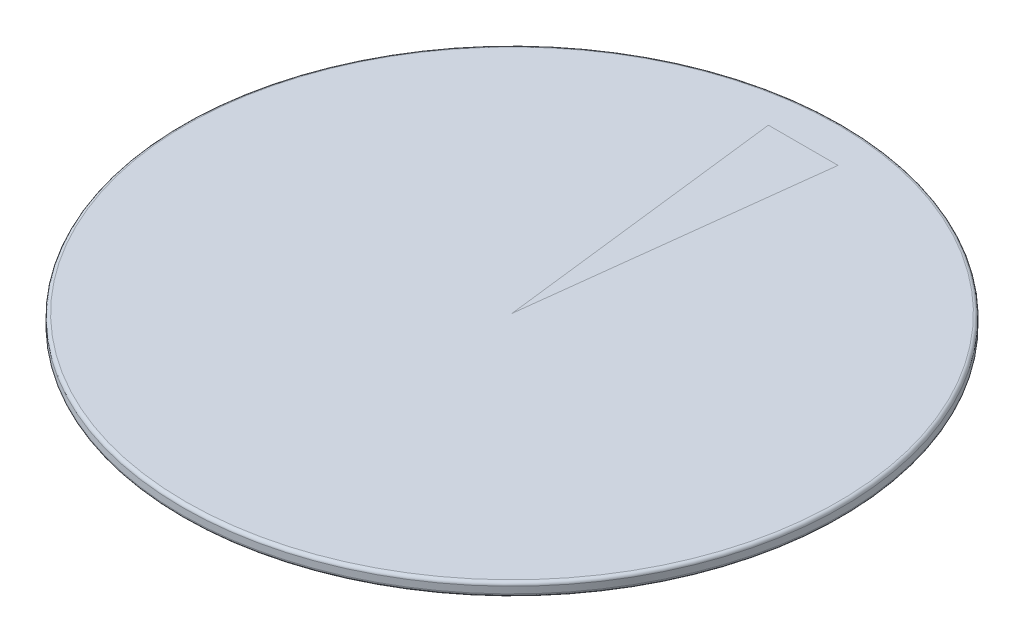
from build123d import *

# Parameters (mm, degrees)
SKETCH1_R           = 25
BOSS_EXTRUDE1_DEPTH = 1
FILLET1_R           = 0.25


with BuildPart() as part:
    # Sketch1 → Boss-Extrude1 (new body)
    with BuildSketch(Plane(origin=(0, 0, 0), x_dir=(1, 0, 0), z_dir=(0, 1, 0))):
        with Locations(Location((0, 0, 0), (0, 0, 270))):
            Circle(SKETCH1_R)
    extrude(amount=BOSS_EXTRUDE1_DEPTH)

    # Fillet1
    fillet1_edges = [part.edges().sort_by_distance(p)[0] for p in [
        (0, 0, -25),
        (0, 1, -25),
    ]]
    fillet(fillet1_edges, radius=FILLET1_R)


solid = part.part
